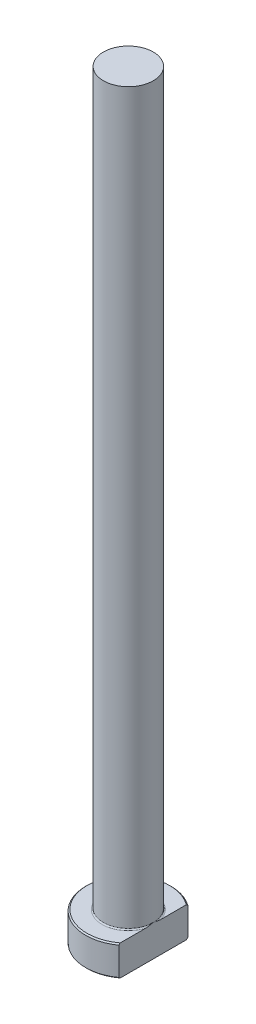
from build123d import *
from build123d.topology import SkipClean

# Parameters (mm, degrees)
CHAMFER1_SIZE = 0.2
FILLET1_R     = 0.2
KEY_DEPTH     = 126.391387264


with BuildPart() as part:
    # Sketch1 → Revolve1 (revolve)
    with BuildSketch(Plane.XY, mode=Mode.PRIVATE) as revolve1_sk:
        Polygon((0, 0), (-7, 0), (-7, 5), (-4.1, 5), (-4.1, 125), (0, 125), align=None)
    revolve(revolve1_sk.sketch.rotate(Axis((0, 259.958771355, 0), (0, -1, 0)), 270), axis=Axis((0, 259.958771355, 0), (0, -1, 0)))

    # Chamfer1
    chamfer1_edges = [part.edges().sort_by_distance(p)[0] for p in [
        (0, 5, -7),
        (0, 0, -7),
    ]]
    chamfer(chamfer1_edges, length=CHAMFER1_SIZE)

    # Fillet1
    fillet1_edges = [part.edges().sort_by_distance(p)[0] for p in [
        (0, 5, -4.1),
    ]]
    fillet(fillet1_edges, radius=FILLET1_R)

    # Sketch2 → KEY (cut, through all)
    with SkipClean():  # the faces are left unmerged after this step: merging them gives an invalid solid
        with BuildSketch(Plane(origin=(0, 0, 0), x_dir=(1, 0, 0), z_dir=(0, 1, 0))):
            with BuildLine():
                Line((4.1, 5.673623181), (4.1, -5.673623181))
                ThreePointArc((4.1, -5.673623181), (7, 0), (4.1, 5.673623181))
            make_face()
        extrude(amount=KEY_DEPTH, mode=Mode.SUBTRACT)


solid = part.part
